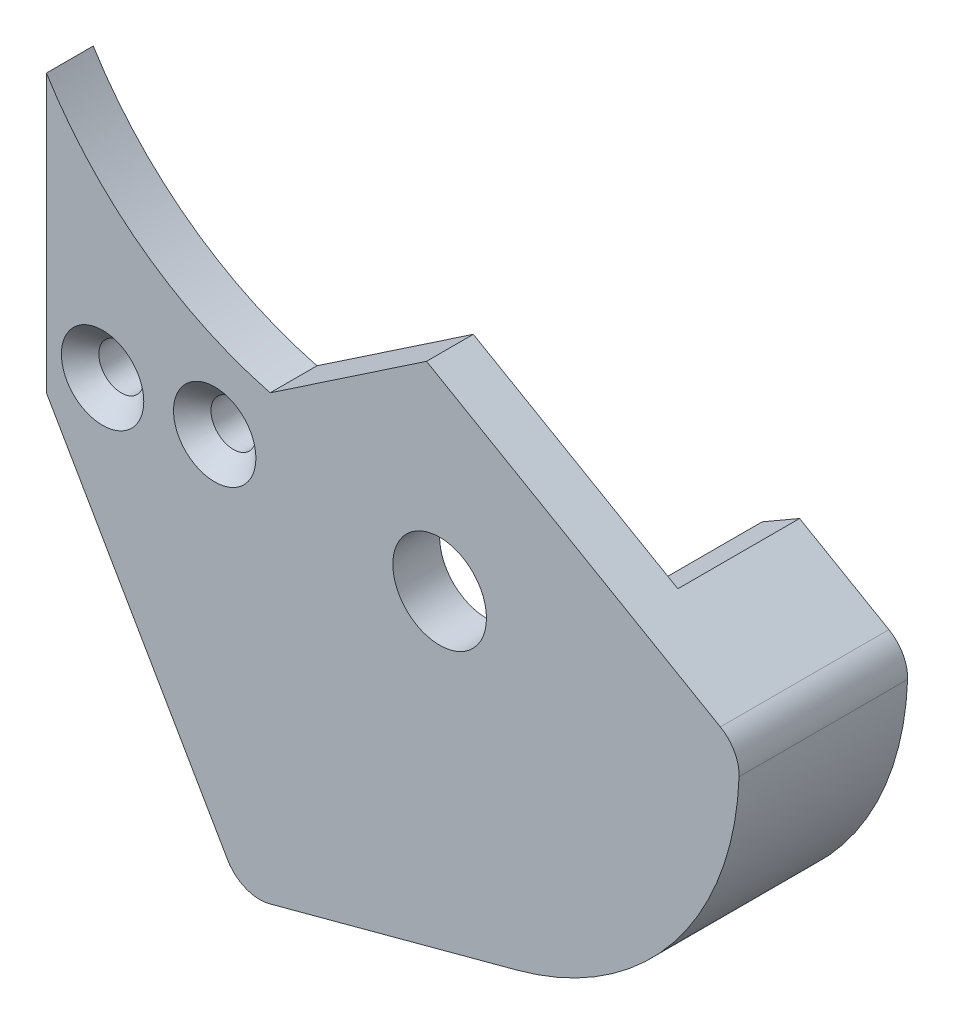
ISO-10303-21;
HEADER;
FILE_DESCRIPTION(('STEP AP214'),'2;1');
FILE_NAME('part.step','',(''),(''),'','','');
FILE_SCHEMA(('AUTOMOTIVE_DESIGN { 1 0 10303 214 1 1 1 1 }'));
ENDSEC;
DATA;
#1=APPLICATION_CONTEXT('core data for automotive mechanical design processes');
#2=APPLICATION_PROTOCOL_DEFINITION('international standard','automotive_design',2000,#1);
#3=PRODUCT_CONTEXT('',#1,'mechanical');
#4=PRODUCT('Part','Part','',(#3));
#5=PRODUCT_RELATED_PRODUCT_CATEGORY('part','',(#4));
#6=PRODUCT_DEFINITION_FORMATION('','',#4);
#7=PRODUCT_DEFINITION_CONTEXT('part definition',#1,'design');
#8=PRODUCT_DEFINITION('design','',#6,#7);
#9=PRODUCT_DEFINITION_SHAPE('','',#8);
#10=(LENGTH_UNIT() NAMED_UNIT(*) SI_UNIT(.MILLI.,.METRE.));
#11=(NAMED_UNIT(*) PLANE_ANGLE_UNIT() SI_UNIT($,.RADIAN.));
#12=(NAMED_UNIT(*) SI_UNIT($,.STERADIAN.) SOLID_ANGLE_UNIT());
#13=UNCERTAINTY_MEASURE_WITH_UNIT(LENGTH_MEASURE(1.E-05),#10,'distance_accuracy_value','');
#14=(GEOMETRIC_REPRESENTATION_CONTEXT(3) GLOBAL_UNCERTAINTY_ASSIGNED_CONTEXT((#13)) GLOBAL_UNIT_ASSIGNED_CONTEXT((#10,
#11,#12)) REPRESENTATION_CONTEXT('',''));
#15=CARTESIAN_POINT('',(0.,0.,0.));
#16=DIRECTION('',(0.,0.,1.));
#17=DIRECTION('',(1.,0.,0.));
#18=AXIS2_PLACEMENT_3D('',#15,#16,#17);
#19=CARTESIAN_POINT('',(29.3988570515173,26.4335149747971,0.));
#20=DIRECTION('',(0.,0.,-1.));
#21=DIRECTION('',(-1.,0.,0.));
#22=AXIS2_PLACEMENT_3D('',#19,#20,#21);
#23=PLANE('',#22);
#24=DIRECTION('',(-0.866025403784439,-0.5,0.));
#25=VECTOR('',#24,1.);
#26=CARTESIAN_POINT('',(25.9942197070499,33.3305198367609,0.));
#27=LINE('',#26,#25);
#28=CARTESIAN_POINT('',(25.5612070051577,33.0805198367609,0.));
#29=VERTEX_POINT('',#28);
#30=CARTESIAN_POINT('',(23.8291561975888,32.0805198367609,0.));
#31=VERTEX_POINT('',#30);
#32=EDGE_CURVE('E11',#29,#31,#27,.T.);
#33=ORIENTED_EDGE('',*,*,#32,.F.);
#34=DIRECTION('',(-0.5,0.866025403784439,0.));
#35=VECTOR('',#34,1.);
#36=CARTESIAN_POINT('',(19.7320508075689,43.1769145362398,0.));
#37=LINE('',#36,#35);
#38=CARTESIAN_POINT('',(28.6315300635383,27.7625643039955,0.));
#39=VERTEX_POINT('',#38);
#40=EDGE_CURVE('E258',#39,#29,#37,.T.);
#41=ORIENTED_EDGE('',*,*,#40,.F.);
#42=CARTESIAN_POINT('',(30.3635808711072,28.7625643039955,0.));
#43=DIRECTION('',(0.,0.,-1.));
#44=DIRECTION('',(-1.,0.,0.));
#45=AXIS2_PLACEMENT_3D('',#42,#43,#44);
#46=CIRCLE('',#45,2.);
#47=CARTESIAN_POINT('',(30.8812189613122,26.8307126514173,0.));
#48=VERTEX_POINT('',#47);
#49=EDGE_CURVE('E283',#48,#39,#46,.T.);
#50=ORIENTED_EDGE('',*,*,#49,.F.);
#51=DIRECTION('',(-0.965925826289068,-0.258819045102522,0.));
#52=VECTOR('',#51,1.);
#53=CARTESIAN_POINT('',(30.8812189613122,26.8307126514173,0.));
#54=LINE('',#53,#52);
#55=CARTESIAN_POINT('',(42.6234666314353,29.9770384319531,0.));
#56=VERTEX_POINT('',#55);
#57=EDGE_CURVE('E284',#56,#48,#54,.T.);
#58=ORIENTED_EDGE('',*,*,#57,.F.);
#59=CARTESIAN_POINT('',(39.,43.5,0.));
#60=DIRECTION('',(0.,0.,-1.));
#61=DIRECTION('',(1.,0.,0.));
#62=AXIS2_PLACEMENT_3D('',#59,#60,#61);
#63=CIRCLE('',#62,14.);
#64=CARTESIAN_POINT('',(52.8734632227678,41.6219642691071,0.));
#65=VERTEX_POINT('',#64);
#66=EDGE_CURVE('E341',#65,#56,#63,.T.);
#67=ORIENTED_EDGE('',*,*,#66,.F.);
#68=CARTESIAN_POINT('',(50.8915399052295,41.8902550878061,0.));
#69=DIRECTION('',(0.,0.,-1.));
#70=DIRECTION('',(-1.,0.,0.));
#71=AXIS2_PLACEMENT_3D('',#68,#69,#70);
#72=CIRCLE('',#71,2.);
#73=CARTESIAN_POINT('',(51.8915399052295,43.6223058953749,0.));
#74=VERTEX_POINT('',#73);
#75=EDGE_CURVE('E339',#74,#65,#72,.T.);
#76=ORIENTED_EDGE('',*,*,#75,.F.);
#77=DIRECTION('',(0.866025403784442,-0.499999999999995,0.));
#78=VECTOR('',#77,1.);
#79=CARTESIAN_POINT('',(47.2204784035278,46.3191445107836,0.));
#80=LINE('',#79,#78);
#81=CARTESIAN_POINT('',(47.2204784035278,46.3191445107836,0.));
#82=VERTEX_POINT('',#81);
#83=EDGE_CURVE('E337',#82,#74,#80,.T.);
#84=ORIENTED_EDGE('',*,*,#83,.F.);
#85=DIRECTION('',(-0.866025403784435,-0.500000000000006,0.));
#86=VECTOR('',#85,1.);
#87=CARTESIAN_POINT('',(47.2204784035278,46.3191445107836,0.));
#88=LINE('',#87,#86);
#89=CARTESIAN_POINT('',(49.2204784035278,47.4738450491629,0.));
#90=VERTEX_POINT('',#89);
#91=EDGE_CURVE('E335',#90,#82,#88,.T.);
#92=ORIENTED_EDGE('',*,*,#91,.F.);
#93=DIRECTION('',(-0.866025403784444,0.499999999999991,0.));
#94=VECTOR('',#93,1.);
#95=CARTESIAN_POINT('',(49.2204784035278,47.4738450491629,0.));
#96=LINE('',#95,#94);
#97=CARTESIAN_POINT('',(53.9906253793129,44.7197994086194,0.));
#98=VERTEX_POINT('',#97);
#99=EDGE_CURVE('E247',#98,#90,#96,.T.);
#100=ORIENTED_EDGE('',*,*,#99,.F.);
#101=CARTESIAN_POINT('',(52.9906253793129,42.9877486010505,0.));
#102=DIRECTION('',(0.,0.,1.));
#103=DIRECTION('',(-1.,0.,0.));
#104=AXIS2_PLACEMENT_3D('',#101,#102,#103);
#105=CIRCLE('',#104,2.);
#106=CARTESIAN_POINT('',(54.9892861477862,42.914569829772,0.));
#107=VERTEX_POINT('',#106);
#108=EDGE_CURVE('E332',#107,#98,#105,.T.);
#109=ORIENTED_EDGE('',*,*,#108,.F.);
#110=CARTESIAN_POINT('',(39.,43.5,0.));
#111=DIRECTION('',(0.,0.,1.));
#112=DIRECTION('',(1.,0.,0.));
#113=AXIS2_PLACEMENT_3D('',#110,#111,#112);
#114=CIRCLE('',#113,16.);
#115=CARTESIAN_POINT('',(43.1411047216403,28.0451867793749,0.));
#116=VERTEX_POINT('',#115);
#117=EDGE_CURVE('E327',#116,#107,#114,.T.);
#118=ORIENTED_EDGE('',*,*,#117,.F.);
#119=DIRECTION('',(0.965925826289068,0.258819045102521,0.));
#120=VECTOR('',#119,1.);
#121=CARTESIAN_POINT('',(29.9164951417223,24.501663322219,0.));
#122=LINE('',#121,#120);
#123=CARTESIAN_POINT('',(29.9164951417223,24.501663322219,0.));
#124=VERTEX_POINT('',#123);
#125=EDGE_CURVE('E325',#124,#116,#122,.T.);
#126=ORIENTED_EDGE('',*,*,#125,.F.);
#127=CARTESIAN_POINT('',(29.3988570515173,26.4335149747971,0.));
#128=DIRECTION('',(0.,0.,1.));
#129=DIRECTION('',(-1.,0.,0.));
#130=AXIS2_PLACEMENT_3D('',#127,#128,#129);
#131=CIRCLE('',#130,2.);
#132=CARTESIAN_POINT('',(27.6668062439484,25.4335149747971,0.));
#133=VERTEX_POINT('',#132);
#134=EDGE_CURVE('E318',#133,#124,#131,.T.);
#135=ORIENTED_EDGE('',*,*,#134,.F.);
#136=DIRECTION('',(0.5,-0.866025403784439,0.));
#137=VECTOR('',#136,1.);
#138=CARTESIAN_POINT('',(18.,42.1769145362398,0.));
#139=LINE('',#138,#137);
#140=EDGE_CURVE('E202',#31,#133,#139,.T.);
#141=ORIENTED_EDGE('',*,*,#140,.F.);
#142=EDGE_LOOP('',(#33,#41,#50,#58,#67,#76,#84,#92,#100,#109,#118,#126,#135,#141));
#143=FACE_BOUND('',#142,.T.);
#144=ADVANCED_FACE('F33',(#143),#23,.T.);
#145=CARTESIAN_POINT('',(18.,42.1769145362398,6.5));
#146=DIRECTION('',(0.866025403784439,0.5,0.));
#147=DIRECTION('',(-0.5,0.866025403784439,0.));
#148=AXIS2_PLACEMENT_3D('',#145,#146,#147);
#149=PLANE('',#148);
#150=CARTESIAN_POINT('',(18.,42.1769145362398,0.));
#151=VERTEX_POINT('',#150);
#152=CARTESIAN_POINT('',(22.1708438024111,34.95280116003,0.));
#153=VERTEX_POINT('',#152);
#154=EDGE_CURVE('E205',#151,#153,#139,.T.);
#155=ORIENTED_EDGE('',*,*,#154,.T.);
#156=CARTESIAN_POINT('',(23.,33.5166604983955,2.5));
#157=DIRECTION('',(-0.866025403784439,-0.5,0.));
#158=DIRECTION('',(0.5,-0.866025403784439,0.));
#159=AXIS2_PLACEMENT_3D('',#156,#157,#158);
#160=CIRCLE('',#159,3.);
#161=EDGE_CURVE('E56',#31,#153,#160,.T.);
#162=ORIENTED_EDGE('',*,*,#161,.F.);
#163=ORIENTED_EDGE('',*,*,#140,.T.);
#164=DIRECTION('',(0.,0.,-1.));
#165=VECTOR('',#164,1.);
#166=CARTESIAN_POINT('',(27.6668062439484,25.4335149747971,6.5));
#167=LINE('',#166,#165);
#168=CARTESIAN_POINT('',(27.6668062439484,25.4335149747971,9.));
#169=VERTEX_POINT('',#168);
#170=EDGE_CURVE('E197',#169,#133,#167,.T.);
#171=ORIENTED_EDGE('',*,*,#170,.F.);
#172=DIRECTION('',(0.5,-0.866025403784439,0.));
#173=VECTOR('',#172,1.);
#174=CARTESIAN_POINT('',(18.,42.1769145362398,9.));
#175=LINE('',#174,#173);
#176=CARTESIAN_POINT('',(18.,42.1769145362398,9.));
#177=VERTEX_POINT('',#176);
#178=EDGE_CURVE('E200',#177,#169,#175,.T.);
#179=ORIENTED_EDGE('',*,*,#178,.F.);
#180=DIRECTION('',(0.,0.,-1.));
#181=VECTOR('',#180,1.);
#182=CARTESIAN_POINT('',(18.,42.1769145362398,9.));
#183=LINE('',#182,#181);
#184=CARTESIAN_POINT('',(18.,42.1769145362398,6.5));
#185=VERTEX_POINT('',#184);
#186=EDGE_CURVE('E173',#177,#185,#183,.T.);
#187=ORIENTED_EDGE('',*,*,#186,.T.);
#188=DIRECTION('',(0.,0.,-1.));
#189=VECTOR('',#188,1.);
#190=CARTESIAN_POINT('',(18.,42.1769145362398,6.5));
#191=LINE('',#190,#189);
#192=EDGE_CURVE('E192',#185,#151,#191,.T.);
#193=ORIENTED_EDGE('',*,*,#192,.T.);
#194=EDGE_LOOP('',(#155,#162,#163,#171,#179,#187,#193));
#195=FACE_BOUND('',#194,.T.);
#196=ADVANCED_FACE('F35',(#195),#149,.F.);
#197=CARTESIAN_POINT('',(29.3988570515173,26.4335149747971,6.5));
#198=DIRECTION('',(0.,0.,-1.));
#199=DIRECTION('',(-1.,0.,0.));
#200=AXIS2_PLACEMENT_3D('',#197,#198,#199);
#201=CYLINDRICAL_SURFACE('',#200,2.);
#202=ORIENTED_EDGE('',*,*,#134,.T.);
#203=DIRECTION('',(0.,0.,-1.));
#204=VECTOR('',#203,1.);
#205=CARTESIAN_POINT('',(29.9164951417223,24.501663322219,6.5));
#206=LINE('',#205,#204);
#207=CARTESIAN_POINT('',(29.9164951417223,24.501663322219,9.));
#208=VERTEX_POINT('',#207);
#209=EDGE_CURVE('E310',#208,#124,#206,.T.);
#210=ORIENTED_EDGE('',*,*,#209,.F.);
#211=CARTESIAN_POINT('',(29.3988570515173,26.4335149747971,9.));
#212=DIRECTION('',(0.,0.,1.));
#213=DIRECTION('',(-1.,0.,0.));
#214=AXIS2_PLACEMENT_3D('',#211,#212,#213);
#215=CIRCLE('',#214,2.);
#216=EDGE_CURVE('E320',#169,#208,#215,.T.);
#217=ORIENTED_EDGE('',*,*,#216,.F.);
#218=ORIENTED_EDGE('',*,*,#170,.T.);
#219=EDGE_LOOP('',(#202,#210,#217,#218));
#220=FACE_BOUND('',#219,.T.);
#221=ADVANCED_FACE('F317',(#220),#201,.T.);
#222=CARTESIAN_POINT('',(29.9164951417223,24.501663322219,6.5));
#223=DIRECTION('',(-0.258819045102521,0.965925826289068,0.));
#224=DIRECTION('',(-0.965925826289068,-0.258819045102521,0.));
#225=AXIS2_PLACEMENT_3D('',#222,#223,#224);
#226=PLANE('',#225);
#227=ORIENTED_EDGE('',*,*,#125,.T.);
#228=DIRECTION('',(0.,0.,-1.));
#229=VECTOR('',#228,1.);
#230=CARTESIAN_POINT('',(43.1411047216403,28.0451867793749,6.5));
#231=LINE('',#230,#229);
#232=CARTESIAN_POINT('',(43.1411047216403,28.0451867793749,9.));
#233=VERTEX_POINT('',#232);
#234=EDGE_CURVE('E307',#233,#116,#231,.T.);
#235=ORIENTED_EDGE('',*,*,#234,.F.);
#236=DIRECTION('',(0.965925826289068,0.258819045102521,0.));
#237=VECTOR('',#236,1.);
#238=CARTESIAN_POINT('',(29.9164951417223,24.501663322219,9.));
#239=LINE('',#238,#237);
#240=EDGE_CURVE('E364',#208,#233,#239,.T.);
#241=ORIENTED_EDGE('',*,*,#240,.F.);
#242=ORIENTED_EDGE('',*,*,#209,.T.);
#243=EDGE_LOOP('',(#227,#235,#241,#242));
#244=FACE_BOUND('',#243,.T.);
#245=ADVANCED_FACE('F487',(#244),#226,.F.);
#246=CARTESIAN_POINT('',(39.,43.5,6.5));
#247=DIRECTION('',(0.,0.,-1.));
#248=DIRECTION('',(-1.,0.,0.));
#249=AXIS2_PLACEMENT_3D('',#246,#247,#248);
#250=CYLINDRICAL_SURFACE('',#249,16.);
#251=ORIENTED_EDGE('',*,*,#117,.T.);
#252=DIRECTION('',(0.,0.,-1.));
#253=VECTOR('',#252,1.);
#254=CARTESIAN_POINT('',(54.9892861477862,42.914569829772,6.5));
#255=LINE('',#254,#253);
#256=CARTESIAN_POINT('',(54.9892861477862,42.914569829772,9.));
#257=VERTEX_POINT('',#256);
#258=EDGE_CURVE('E304',#257,#107,#255,.T.);
#259=ORIENTED_EDGE('',*,*,#258,.F.);
#260=CARTESIAN_POINT('',(39.,43.5,9.));
#261=DIRECTION('',(0.,0.,1.));
#262=DIRECTION('',(1.,0.,0.));
#263=AXIS2_PLACEMENT_3D('',#260,#261,#262);
#264=CIRCLE('',#263,16.);
#265=EDGE_CURVE('E367',#233,#257,#264,.T.);
#266=ORIENTED_EDGE('',*,*,#265,.F.);
#267=ORIENTED_EDGE('',*,*,#234,.T.);
#268=EDGE_LOOP('',(#251,#259,#266,#267));
#269=FACE_BOUND('',#268,.T.);
#270=ADVANCED_FACE('F477',(#269),#250,.T.);
#271=CARTESIAN_POINT('',(52.9906253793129,42.9877486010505,6.5));
#272=DIRECTION('',(0.,0.,-1.));
#273=DIRECTION('',(-1.,0.,0.));
#274=AXIS2_PLACEMENT_3D('',#271,#272,#273);
#275=CYLINDRICAL_SURFACE('',#274,2.);
#276=ORIENTED_EDGE('',*,*,#108,.T.);
#277=DIRECTION('',(0.,0.,-1.));
#278=VECTOR('',#277,1.);
#279=CARTESIAN_POINT('',(53.9906253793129,44.7197994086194,6.5));
#280=LINE('',#279,#278);
#281=CARTESIAN_POINT('',(53.9906253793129,44.7197994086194,9.));
#282=VERTEX_POINT('',#281);
#283=EDGE_CURVE('E250',#282,#98,#280,.T.);
#284=ORIENTED_EDGE('',*,*,#283,.F.);
#285=CARTESIAN_POINT('',(52.9906253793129,42.9877486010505,9.));
#286=DIRECTION('',(0.,0.,1.));
#287=DIRECTION('',(-1.,0.,0.));
#288=AXIS2_PLACEMENT_3D('',#285,#286,#287);
#289=CIRCLE('',#288,2.);
#290=EDGE_CURVE('E370',#257,#282,#289,.T.);
#291=ORIENTED_EDGE('',*,*,#290,.F.);
#292=ORIENTED_EDGE('',*,*,#258,.T.);
#293=EDGE_LOOP('',(#276,#284,#291,#292));
#294=FACE_BOUND('',#293,.T.);
#295=ADVANCED_FACE('F380',(#294),#275,.T.);
#296=CARTESIAN_POINT('',(49.2204784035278,47.4738450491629,6.5));
#297=DIRECTION('',(-0.499999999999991,-0.866025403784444,0.));
#298=DIRECTION('',(0.866025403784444,-0.499999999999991,0.));
#299=AXIS2_PLACEMENT_3D('',#296,#297,#298);
#300=PLANE('',#299);
#301=ORIENTED_EDGE('',*,*,#99,.T.);
#302=DIRECTION('',(0.,0.,-1.));
#303=VECTOR('',#302,1.);
#304=CARTESIAN_POINT('',(49.2204784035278,47.4738450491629,6.5));
#305=LINE('',#304,#303);
#306=CARTESIAN_POINT('',(49.2204784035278,47.4738450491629,6.5));
#307=VERTEX_POINT('',#306);
#308=EDGE_CURVE('E244',#307,#90,#305,.T.);
#309=ORIENTED_EDGE('',*,*,#308,.F.);
#310=DIRECTION('',(-0.866025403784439,0.5,0.));
#311=VECTOR('',#310,1.);
#312=CARTESIAN_POINT('',(38.2975696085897,53.7801893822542,6.5));
#313=LINE('',#312,#311);
#314=CARTESIAN_POINT('',(38.2975696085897,53.7801893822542,6.5));
#315=VERTEX_POINT('',#314);
#316=EDGE_CURVE('E178',#307,#315,#313,.T.);
#317=ORIENTED_EDGE('',*,*,#316,.T.);
#318=DIRECTION('',(0.,0.,-1.));
#319=VECTOR('',#318,1.);
#320=CARTESIAN_POINT('',(38.2975696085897,53.7801893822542,9.));
#321=LINE('',#320,#319);
#322=CARTESIAN_POINT('',(38.2975696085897,53.7801893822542,9.));
#323=VERTEX_POINT('',#322);
#324=EDGE_CURVE('E203',#323,#315,#321,.T.);
#325=ORIENTED_EDGE('',*,*,#324,.F.);
#326=DIRECTION('',(-0.866025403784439,0.5,0.));
#327=VECTOR('',#326,1.);
#328=CARTESIAN_POINT('',(38.2975696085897,53.7801893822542,9.));
#329=LINE('',#328,#327);
#330=EDGE_CURVE('E242',#282,#323,#329,.T.);
#331=ORIENTED_EDGE('',*,*,#330,.F.);
#332=ORIENTED_EDGE('',*,*,#283,.T.);
#333=EDGE_LOOP('',(#301,#309,#317,#325,#331,#332));
#334=FACE_BOUND('',#333,.T.);
#335=ADVANCED_FACE('F240',(#334),#300,.F.);
#336=CARTESIAN_POINT('',(47.2204784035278,46.3191445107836,6.5));
#337=DIRECTION('',(0.500000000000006,-0.866025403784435,0.));
#338=DIRECTION('',(0.866025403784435,0.500000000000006,0.));
#339=AXIS2_PLACEMENT_3D('',#336,#337,#338);
#340=PLANE('',#339);
#341=ORIENTED_EDGE('',*,*,#91,.T.);
#342=DIRECTION('',(0.,0.,-1.));
#343=VECTOR('',#342,1.);
#344=CARTESIAN_POINT('',(47.2204784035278,46.3191445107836,6.5));
#345=LINE('',#344,#343);
#346=CARTESIAN_POINT('',(47.2204784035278,46.3191445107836,6.5));
#347=VERTEX_POINT('',#346);
#348=EDGE_CURVE('E251',#347,#82,#345,.T.);
#349=ORIENTED_EDGE('',*,*,#348,.F.);
#350=DIRECTION('',(-0.866025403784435,-0.500000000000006,0.));
#351=VECTOR('',#350,1.);
#352=CARTESIAN_POINT('',(47.2204784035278,46.3191445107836,6.5));
#353=LINE('',#352,#351);
#354=EDGE_CURVE('E253',#307,#347,#353,.T.);
#355=ORIENTED_EDGE('',*,*,#354,.F.);
#356=ORIENTED_EDGE('',*,*,#308,.T.);
#357=EDGE_LOOP('',(#341,#349,#355,#356));
#358=FACE_BOUND('',#357,.T.);
#359=ADVANCED_FACE('F254',(#358),#340,.F.);
#360=CARTESIAN_POINT('',(47.2204784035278,46.3191445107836,6.5));
#361=DIRECTION('',(0.499999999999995,0.866025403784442,0.));
#362=DIRECTION('',(-0.866025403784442,0.499999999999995,0.));
#363=AXIS2_PLACEMENT_3D('',#360,#361,#362);
#364=PLANE('',#363);
#365=ORIENTED_EDGE('',*,*,#83,.T.);
#366=DIRECTION('',(0.,0.,-1.));
#367=VECTOR('',#366,1.);
#368=CARTESIAN_POINT('',(51.8915399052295,43.6223058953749,6.5));
#369=LINE('',#368,#367);
#370=CARTESIAN_POINT('',(51.8915399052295,43.6223058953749,6.5));
#371=VERTEX_POINT('',#370);
#372=EDGE_CURVE('E299',#371,#74,#369,.T.);
#373=ORIENTED_EDGE('',*,*,#372,.F.);
#374=DIRECTION('',(0.866025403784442,-0.499999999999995,0.));
#375=VECTOR('',#374,1.);
#376=CARTESIAN_POINT('',(47.2204784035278,46.3191445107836,6.5));
#377=LINE('',#376,#375);
#378=EDGE_CURVE('E215',#347,#371,#377,.T.);
#379=ORIENTED_EDGE('',*,*,#378,.F.);
#380=ORIENTED_EDGE('',*,*,#348,.T.);
#381=EDGE_LOOP('',(#365,#373,#379,#380));
#382=FACE_BOUND('',#381,.T.);
#383=ADVANCED_FACE('F385',(#382),#364,.F.);
#384=CARTESIAN_POINT('',(50.8915399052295,41.8902550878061,6.5));
#385=DIRECTION('',(0.,0.,-1.));
#386=DIRECTION('',(-1.,0.,0.));
#387=AXIS2_PLACEMENT_3D('',#384,#385,#386);
#388=CYLINDRICAL_SURFACE('',#387,2.);
#389=ORIENTED_EDGE('',*,*,#75,.T.);
#390=DIRECTION('',(0.,0.,-1.));
#391=VECTOR('',#390,1.);
#392=CARTESIAN_POINT('',(52.8734632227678,41.6219642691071,6.5));
#393=LINE('',#392,#391);
#394=CARTESIAN_POINT('',(52.8734632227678,41.6219642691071,6.5));
#395=VERTEX_POINT('',#394);
#396=EDGE_CURVE('E296',#395,#65,#393,.T.);
#397=ORIENTED_EDGE('',*,*,#396,.F.);
#398=CARTESIAN_POINT('',(50.8915399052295,41.8902550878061,6.5));
#399=DIRECTION('',(0.,0.,-1.));
#400=DIRECTION('',(-1.,0.,0.));
#401=AXIS2_PLACEMENT_3D('',#398,#399,#400);
#402=CIRCLE('',#401,2.);
#403=EDGE_CURVE('E260',#371,#395,#402,.T.);
#404=ORIENTED_EDGE('',*,*,#403,.F.);
#405=ORIENTED_EDGE('',*,*,#372,.T.);
#406=EDGE_LOOP('',(#389,#397,#404,#405));
#407=FACE_BOUND('',#406,.T.);
#408=ADVANCED_FACE('F396',(#407),#388,.F.);
#409=CARTESIAN_POINT('',(39.,43.5,6.5));
#410=DIRECTION('',(0.,0.,-1.));
#411=DIRECTION('',(-1.,0.,0.));
#412=AXIS2_PLACEMENT_3D('',#409,#410,#411);
#413=CYLINDRICAL_SURFACE('',#412,14.);
#414=ORIENTED_EDGE('',*,*,#66,.T.);
#415=DIRECTION('',(0.,0.,-1.));
#416=VECTOR('',#415,1.);
#417=CARTESIAN_POINT('',(42.6234666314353,29.9770384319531,6.5));
#418=LINE('',#417,#416);
#419=CARTESIAN_POINT('',(42.6234666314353,29.9770384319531,6.5));
#420=VERTEX_POINT('',#419);
#421=EDGE_CURVE('E293',#420,#56,#418,.T.);
#422=ORIENTED_EDGE('',*,*,#421,.F.);
#423=CARTESIAN_POINT('',(39.,43.5,6.5));
#424=DIRECTION('',(0.,0.,-1.));
#425=DIRECTION('',(1.,0.,0.));
#426=AXIS2_PLACEMENT_3D('',#423,#424,#425);
#427=CIRCLE('',#426,14.);
#428=EDGE_CURVE('E390',#395,#420,#427,.T.);
#429=ORIENTED_EDGE('',*,*,#428,.F.);
#430=ORIENTED_EDGE('',*,*,#396,.T.);
#431=EDGE_LOOP('',(#414,#422,#429,#430));
#432=FACE_BOUND('',#431,.T.);
#433=ADVANCED_FACE('F398',(#432),#413,.F.);
#434=CARTESIAN_POINT('',(30.8812189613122,26.8307126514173,6.5));
#435=DIRECTION('',(0.258819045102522,-0.965925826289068,0.));
#436=DIRECTION('',(0.965925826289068,0.258819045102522,0.));
#437=AXIS2_PLACEMENT_3D('',#434,#435,#436);
#438=PLANE('',#437);
#439=ORIENTED_EDGE('',*,*,#57,.T.);
#440=DIRECTION('',(0.,0.,-1.));
#441=VECTOR('',#440,1.);
#442=CARTESIAN_POINT('',(30.8812189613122,26.8307126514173,6.5));
#443=LINE('',#442,#441);
#444=CARTESIAN_POINT('',(30.8812189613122,26.8307126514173,6.5));
#445=VERTEX_POINT('',#444);
#446=EDGE_CURVE('E290',#445,#48,#443,.T.);
#447=ORIENTED_EDGE('',*,*,#446,.F.);
#448=DIRECTION('',(-0.965925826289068,-0.258819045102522,0.));
#449=VECTOR('',#448,1.);
#450=CARTESIAN_POINT('',(30.8812189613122,26.8307126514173,6.5));
#451=LINE('',#450,#449);
#452=EDGE_CURVE('E392',#420,#445,#451,.T.);
#453=ORIENTED_EDGE('',*,*,#452,.F.);
#454=ORIENTED_EDGE('',*,*,#421,.T.);
#455=EDGE_LOOP('',(#439,#447,#453,#454));
#456=FACE_BOUND('',#455,.T.);
#457=ADVANCED_FACE('F344',(#456),#438,.F.);
#458=CARTESIAN_POINT('',(30.3635808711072,28.7625643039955,6.5));
#459=DIRECTION('',(0.,0.,-1.));
#460=DIRECTION('',(-1.,0.,0.));
#461=AXIS2_PLACEMENT_3D('',#458,#459,#460);
#462=CYLINDRICAL_SURFACE('',#461,2.);
#463=ORIENTED_EDGE('',*,*,#49,.T.);
#464=DIRECTION('',(0.,0.,-1.));
#465=VECTOR('',#464,1.);
#466=CARTESIAN_POINT('',(28.6315300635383,27.7625643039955,6.5));
#467=LINE('',#466,#465);
#468=CARTESIAN_POINT('',(28.6315300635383,27.7625643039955,6.5));
#469=VERTEX_POINT('',#468);
#470=EDGE_CURVE('E288',#469,#39,#467,.T.);
#471=ORIENTED_EDGE('',*,*,#470,.F.);
#472=CARTESIAN_POINT('',(30.3635808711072,28.7625643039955,6.5));
#473=DIRECTION('',(0.,0.,-1.));
#474=DIRECTION('',(-1.,0.,0.));
#475=AXIS2_PLACEMENT_3D('',#472,#473,#474);
#476=CIRCLE('',#475,2.);
#477=EDGE_CURVE('E351',#445,#469,#476,.T.);
#478=ORIENTED_EDGE('',*,*,#477,.F.);
#479=ORIENTED_EDGE('',*,*,#446,.T.);
#480=EDGE_LOOP('',(#463,#471,#478,#479));
#481=FACE_BOUND('',#480,.T.);
#482=ADVANCED_FACE('F350',(#481),#462,.F.);
#483=CARTESIAN_POINT('',(19.7320508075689,43.1769145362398,6.5));
#484=DIRECTION('',(-0.866025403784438,-0.5,0.));
#485=DIRECTION('',(0.5,-0.866025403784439,0.));
#486=AXIS2_PLACEMENT_3D('',#483,#484,#485);
#487=PLANE('',#486);
#488=CARTESIAN_POINT('',(23.90289460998,35.95280116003,0.));
#489=VERTEX_POINT('',#488);
#490=CARTESIAN_POINT('',(20.2283441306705,42.3173092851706,0.));
#491=VERTEX_POINT('',#490);
#492=EDGE_CURVE('E262',#489,#491,#37,.T.);
#493=ORIENTED_EDGE('',*,*,#492,.T.);
#494=DIRECTION('',(0.,0.,1.));
#495=VECTOR('',#494,1.);
#496=CARTESIAN_POINT('',(20.2283441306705,42.3173092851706,6.5));
#497=LINE('',#496,#495);
#498=CARTESIAN_POINT('',(20.2283441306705,42.3173092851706,6.5));
#499=VERTEX_POINT('',#498);
#500=EDGE_CURVE('E49',#491,#499,#497,.T.);
#501=ORIENTED_EDGE('',*,*,#500,.T.);
#502=DIRECTION('',(-0.5,0.866025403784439,0.));
#503=VECTOR('',#502,1.);
#504=CARTESIAN_POINT('',(19.7320508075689,43.1769145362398,6.5));
#505=LINE('',#504,#503);
#506=EDGE_CURVE('E188',#469,#499,#505,.T.);
#507=ORIENTED_EDGE('',*,*,#506,.F.);
#508=ORIENTED_EDGE('',*,*,#470,.T.);
#509=ORIENTED_EDGE('',*,*,#40,.T.);
#510=CARTESIAN_POINT('',(24.7320508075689,34.5166604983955,2.5));
#511=DIRECTION('',(-0.866025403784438,-0.5,0.));
#512=DIRECTION('',(0.5,-0.866025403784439,0.));
#513=AXIS2_PLACEMENT_3D('',#510,#511,#512);
#514=CIRCLE('',#513,3.);
#515=EDGE_CURVE('E271',#29,#489,#514,.T.);
#516=ORIENTED_EDGE('',*,*,#515,.T.);
#517=EDGE_LOOP('',(#493,#501,#507,#508,#509,#516));
#518=FACE_BOUND('',#517,.T.);
#519=ADVANCED_FACE('F277',(#518),#487,.F.);
#520=DIRECTION('',(-0.998021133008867,-0.0628793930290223,0.));
#521=VECTOR('',#520,1.);
#522=CARTESIAN_POINT('',(18.,42.1769145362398,0.));
#523=LINE('',#522,#521);
#524=EDGE_CURVE('E189',#491,#151,#523,.T.);
#525=ORIENTED_EDGE('',*,*,#524,.F.);
#526=ORIENTED_EDGE('',*,*,#492,.F.);
#527=DIRECTION('',(-0.866025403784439,-0.5,0.));
#528=VECTOR('',#527,1.);
#529=CARTESIAN_POINT('',(24.3359073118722,36.20280116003,0.));
#530=LINE('',#529,#528);
#531=EDGE_CURVE('E42',#153,#489,#530,.F.);
#532=ORIENTED_EDGE('',*,*,#531,.F.);
#533=ORIENTED_EDGE('',*,*,#154,.F.);
#534=EDGE_LOOP('',(#525,#526,#532,#533));
#535=FACE_BOUND('',#534,.T.);
#536=ADVANCED_FACE('F282',(#535),#23,.T.);
#537=CARTESIAN_POINT('',(35.,67.5,6.5));
#538=DIRECTION('',(0.,0.,1.));
#539=DIRECTION('',(1.,0.,0.));
#540=AXIS2_PLACEMENT_3D('',#537,#538,#539);
#541=PLANE('',#540);
#542=CARTESIAN_POINT('',(26.9881267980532,44.7471686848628,6.5));
#543=DIRECTION('',(0.,0.,1.));
#544=DIRECTION('',(1.,0.,0.));
#545=AXIS2_PLACEMENT_3D('',#542,#543,#544);
#546=CIRCLE('',#545,1.2);
#547=CARTESIAN_POINT('',(28.1881267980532,44.7471686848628,6.5));
#548=VERTEX_POINT('',#547);
#549=EDGE_CURVE('E643',#548,#548,#546,.T.);
#550=ORIENTED_EDGE('',*,*,#549,.T.);
#551=EDGE_LOOP('',(#550));
#552=FACE_BOUND('',#551,.T.);
#553=CARTESIAN_POINT('',(21.,44.3698923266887,6.5));
#554=DIRECTION('',(0.,0.,1.));
#555=DIRECTION('',(1.,0.,0.));
#556=AXIS2_PLACEMENT_3D('',#553,#554,#555);
#557=CIRCLE('',#556,1.2);
#558=CARTESIAN_POINT('',(22.2,44.3698923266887,6.5));
#559=VERTEX_POINT('',#558);
#560=EDGE_CURVE('E37',#559,#559,#557,.T.);
#561=ORIENTED_EDGE('',*,*,#560,.T.);
#562=EDGE_LOOP('',(#561));
#563=FACE_BOUND('',#562,.T.);
#564=DIRECTION('',(-0.998021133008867,-0.0628793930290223,0.));
#565=VECTOR('',#564,1.);
#566=CARTESIAN_POINT('',(18.,42.1769145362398,6.5));
#567=LINE('',#566,#565);
#568=EDGE_CURVE('E182',#499,#185,#567,.T.);
#569=ORIENTED_EDGE('',*,*,#568,.T.);
#570=DIRECTION('',(0.,-1.,0.));
#571=VECTOR('',#570,1.);
#572=CARTESIAN_POINT('',(18.,42.1769145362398,6.5));
#573=LINE('',#572,#571);
#574=CARTESIAN_POINT('',(18.,56.9643462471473,6.5));
#575=VERTEX_POINT('',#574);
#576=EDGE_CURVE('E168',#575,#185,#573,.T.);
#577=ORIENTED_EDGE('',*,*,#576,.F.);
#578=CARTESIAN_POINT('',(35.,67.5,6.5));
#579=DIRECTION('',(0.,0.,-1.));
#580=DIRECTION('',(1.,0.,0.));
#581=AXIS2_PLACEMENT_3D('',#578,#579,#580);
#582=CIRCLE('',#581,20.);
#583=CARTESIAN_POINT('',(29.948140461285,48.1485474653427,6.5));
#584=VERTEX_POINT('',#583);
#585=EDGE_CURVE('E221',#584,#575,#582,.T.);
#586=ORIENTED_EDGE('',*,*,#585,.F.);
#587=DIRECTION('',(-0.829043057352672,-0.559184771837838,0.));
#588=VECTOR('',#587,1.);
#589=CARTESIAN_POINT('',(38.2975696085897,53.7801893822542,6.5));
#590=LINE('',#589,#588);
#591=EDGE_CURVE('E214',#315,#584,#590,.T.);
#592=ORIENTED_EDGE('',*,*,#591,.F.);
#593=ORIENTED_EDGE('',*,*,#316,.F.);
#594=ORIENTED_EDGE('',*,*,#354,.T.);
#595=ORIENTED_EDGE('',*,*,#378,.T.);
#596=ORIENTED_EDGE('',*,*,#403,.T.);
#597=ORIENTED_EDGE('',*,*,#428,.T.);
#598=ORIENTED_EDGE('',*,*,#452,.T.);
#599=ORIENTED_EDGE('',*,*,#477,.T.);
#600=ORIENTED_EDGE('',*,*,#506,.T.);
#601=EDGE_LOOP('',(#569,#577,#586,#592,#593,#594,#595,#596,#597,#598,#599,#600));
#602=FACE_BOUND('',#601,.T.);
#603=CARTESIAN_POINT('',(39.,43.5,6.5));
#604=DIRECTION('',(0.,0.,1.));
#605=DIRECTION('',(1.,0.,0.));
#606=AXIS2_PLACEMENT_3D('',#603,#604,#605);
#607=CIRCLE('',#606,2.5);
#608=CARTESIAN_POINT('',(41.5,43.5,6.5));
#609=VERTEX_POINT('',#608);
#610=EDGE_CURVE('E280',#609,#609,#607,.T.);
#611=ORIENTED_EDGE('',*,*,#610,.T.);
#612=EDGE_LOOP('',(#611));
#613=FACE_BOUND('',#612,.T.);
#614=ADVANCED_FACE('F184',(#552,#563,#602,#613),#541,.F.);
#615=CARTESIAN_POINT('',(35.,67.5,9.));
#616=DIRECTION('',(0.,0.,1.));
#617=DIRECTION('',(1.,0.,0.));
#618=AXIS2_PLACEMENT_3D('',#615,#616,#617);
#619=PLANE('',#618);
#620=CARTESIAN_POINT('',(26.9881267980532,44.7471686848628,9.));
#621=DIRECTION('',(0.,0.,1.));
#622=DIRECTION('',(1.,0.,0.));
#623=AXIS2_PLACEMENT_3D('',#620,#621,#622);
#624=CIRCLE('',#623,2.2);
#625=CARTESIAN_POINT('',(29.1881267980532,44.7471686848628,9.));
#626=VERTEX_POINT('',#625);
#627=EDGE_CURVE('E642',#626,#626,#624,.T.);
#628=ORIENTED_EDGE('',*,*,#627,.F.);
#629=EDGE_LOOP('',(#628));
#630=FACE_BOUND('',#629,.T.);
#631=CARTESIAN_POINT('',(21.,44.3698923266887,9.));
#632=DIRECTION('',(0.,0.,1.));
#633=DIRECTION('',(1.,0.,0.));
#634=AXIS2_PLACEMENT_3D('',#631,#632,#633);
#635=CIRCLE('',#634,2.2);
#636=CARTESIAN_POINT('',(23.2,44.3698923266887,9.));
#637=VERTEX_POINT('',#636);
#638=EDGE_CURVE('E649',#637,#637,#635,.T.);
#639=ORIENTED_EDGE('',*,*,#638,.F.);
#640=EDGE_LOOP('',(#639));
#641=FACE_BOUND('',#640,.T.);
#642=DIRECTION('',(0.,-1.,0.));
#643=VECTOR('',#642,1.);
#644=CARTESIAN_POINT('',(18.,42.1769145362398,9.));
#645=LINE('',#644,#643);
#646=CARTESIAN_POINT('',(18.,56.9643462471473,9.));
#647=VERTEX_POINT('',#646);
#648=EDGE_CURVE('E223',#647,#177,#645,.T.);
#649=ORIENTED_EDGE('',*,*,#648,.T.);
#650=ORIENTED_EDGE('',*,*,#178,.T.);
#651=ORIENTED_EDGE('',*,*,#216,.T.);
#652=ORIENTED_EDGE('',*,*,#240,.T.);
#653=ORIENTED_EDGE('',*,*,#265,.T.);
#654=ORIENTED_EDGE('',*,*,#290,.T.);
#655=ORIENTED_EDGE('',*,*,#330,.T.);
#656=DIRECTION('',(-0.829043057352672,-0.559184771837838,0.));
#657=VECTOR('',#656,1.);
#658=CARTESIAN_POINT('',(38.2975696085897,53.7801893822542,9.));
#659=LINE('',#658,#657);
#660=CARTESIAN_POINT('',(29.948140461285,48.1485474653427,9.));
#661=VERTEX_POINT('',#660);
#662=EDGE_CURVE('E237',#323,#661,#659,.T.);
#663=ORIENTED_EDGE('',*,*,#662,.T.);
#664=CARTESIAN_POINT('',(35.,67.5,9.));
#665=DIRECTION('',(0.,0.,-1.));
#666=DIRECTION('',(1.,0.,0.));
#667=AXIS2_PLACEMENT_3D('',#664,#665,#666);
#668=CIRCLE('',#667,20.);
#669=EDGE_CURVE('E224',#661,#647,#668,.T.);
#670=ORIENTED_EDGE('',*,*,#669,.T.);
#671=EDGE_LOOP('',(#649,#650,#651,#652,#653,#654,#655,#663,#670));
#672=FACE_BOUND('',#671,.T.);
#673=CARTESIAN_POINT('',(39.,43.5,9.));
#674=DIRECTION('',(0.,0.,1.));
#675=DIRECTION('',(1.,0.,0.));
#676=AXIS2_PLACEMENT_3D('',#673,#674,#675);
#677=CIRCLE('',#676,2.5);
#678=CARTESIAN_POINT('',(41.5,43.5,9.));
#679=VERTEX_POINT('',#678);
#680=EDGE_CURVE('E179',#679,#679,#677,.T.);
#681=ORIENTED_EDGE('',*,*,#680,.F.);
#682=EDGE_LOOP('',(#681));
#683=FACE_BOUND('',#682,.T.);
#684=ADVANCED_FACE('F375',(#630,#641,#672,#683),#619,.T.);
#685=CARTESIAN_POINT('',(18.,42.1769145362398,9.));
#686=DIRECTION('',(1.,0.,0.));
#687=DIRECTION('',(0.,0.,-1.));
#688=AXIS2_PLACEMENT_3D('',#685,#686,#687);
#689=PLANE('',#688);
#690=ORIENTED_EDGE('',*,*,#576,.T.);
#691=ORIENTED_EDGE('',*,*,#186,.F.);
#692=ORIENTED_EDGE('',*,*,#648,.F.);
#693=DIRECTION('',(0.,0.,-1.));
#694=VECTOR('',#693,1.);
#695=CARTESIAN_POINT('',(18.,56.9643462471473,9.));
#696=LINE('',#695,#694);
#697=EDGE_CURVE('E175',#647,#575,#696,.T.);
#698=ORIENTED_EDGE('',*,*,#697,.T.);
#699=EDGE_LOOP('',(#690,#691,#692,#698));
#700=FACE_BOUND('',#699,.T.);
#701=ADVANCED_FACE('F170',(#700),#689,.F.);
#702=CARTESIAN_POINT('',(38.2975696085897,53.7801893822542,9.));
#703=DIRECTION('',(0.559184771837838,-0.829043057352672,0.));
#704=DIRECTION('',(0.829043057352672,0.559184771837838,0.));
#705=AXIS2_PLACEMENT_3D('',#702,#703,#704);
#706=PLANE('',#705);
#707=ORIENTED_EDGE('',*,*,#591,.T.);
#708=DIRECTION('',(0.,0.,-1.));
#709=VECTOR('',#708,1.);
#710=CARTESIAN_POINT('',(29.948140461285,48.1485474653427,9.));
#711=LINE('',#710,#709);
#712=EDGE_CURVE('E208',#661,#584,#711,.T.);
#713=ORIENTED_EDGE('',*,*,#712,.F.);
#714=ORIENTED_EDGE('',*,*,#662,.F.);
#715=ORIENTED_EDGE('',*,*,#324,.T.);
#716=EDGE_LOOP('',(#707,#713,#714,#715));
#717=FACE_BOUND('',#716,.T.);
#718=ADVANCED_FACE('F235',(#717),#706,.F.);
#719=CARTESIAN_POINT('',(35.,67.5,9.));
#720=DIRECTION('',(0.,0.,-1.));
#721=DIRECTION('',(-1.,0.,0.));
#722=AXIS2_PLACEMENT_3D('',#719,#720,#721);
#723=CYLINDRICAL_SURFACE('',#722,20.);
#724=ORIENTED_EDGE('',*,*,#585,.T.);
#725=ORIENTED_EDGE('',*,*,#697,.F.);
#726=ORIENTED_EDGE('',*,*,#669,.F.);
#727=ORIENTED_EDGE('',*,*,#712,.T.);
#728=EDGE_LOOP('',(#724,#725,#726,#727));
#729=FACE_BOUND('',#728,.T.);
#730=ADVANCED_FACE('F229',(#729),#723,.F.);
#731=CARTESIAN_POINT('',(39.,43.5,9.));
#732=DIRECTION('',(0.,0.,-1.));
#733=DIRECTION('',(-1.,0.,0.));
#734=AXIS2_PLACEMENT_3D('',#731,#732,#733);
#735=CYLINDRICAL_SURFACE('',#734,2.5);
#736=ORIENTED_EDGE('',*,*,#680,.T.);
#737=EDGE_LOOP('',(#736));
#738=FACE_BOUND('',#737,.T.);
#739=ORIENTED_EDGE('',*,*,#610,.F.);
#740=EDGE_LOOP('',(#739));
#741=FACE_BOUND('',#740,.T.);
#742=ADVANCED_FACE('F606',(#738,#741),#735,.F.);
#743=CARTESIAN_POINT('',(25.1650635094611,34.7666604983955,2.5));
#744=DIRECTION('',(-0.866025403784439,-0.5,0.));
#745=DIRECTION('',(0.5,-0.866025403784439,0.));
#746=AXIS2_PLACEMENT_3D('',#743,#744,#745);
#747=CYLINDRICAL_SURFACE('',#746,3.);
#748=ORIENTED_EDGE('',*,*,#32,.T.);
#749=ORIENTED_EDGE('',*,*,#161,.T.);
#750=ORIENTED_EDGE('',*,*,#531,.T.);
#751=ORIENTED_EDGE('',*,*,#515,.F.);
#752=EDGE_LOOP('',(#748,#749,#750,#751));
#753=FACE_BOUND('',#752,.T.);
#754=ADVANCED_FACE('F270',(#753),#747,.F.);
#755=CARTESIAN_POINT('',(18.,42.1769145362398,6.5));
#756=DIRECTION('',(0.0628793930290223,-0.998021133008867,0.));
#757=DIRECTION('',(0.998021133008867,0.0628793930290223,0.));
#758=AXIS2_PLACEMENT_3D('',#755,#756,#757);
#759=PLANE('',#758);
#760=ORIENTED_EDGE('',*,*,#524,.T.);
#761=ORIENTED_EDGE('',*,*,#192,.F.);
#762=ORIENTED_EDGE('',*,*,#568,.F.);
#763=ORIENTED_EDGE('',*,*,#500,.F.);
#764=EDGE_LOOP('',(#760,#761,#762,#763));
#765=FACE_BOUND('',#764,.T.);
#766=ADVANCED_FACE('F193',(#765),#759,.F.);
#767=CARTESIAN_POINT('',(21.,44.3698923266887,9.));
#768=DIRECTION('',(0.,0.,1.));
#769=DIRECTION('',(1.,0.,0.));
#770=AXIS2_PLACEMENT_3D('',#767,#768,#769);
#771=CYLINDRICAL_SURFACE('',#770,1.2);
#772=CARTESIAN_POINT('',(21.,44.3698923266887,8.));
#773=DIRECTION('',(0.,0.,1.));
#774=DIRECTION('',(1.,0.,0.));
#775=AXIS2_PLACEMENT_3D('',#772,#773,#774);
#776=CIRCLE('',#775,1.2);
#777=CARTESIAN_POINT('',(22.2,44.3698923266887,8.));
#778=VERTEX_POINT('',#777);
#779=EDGE_CURVE('E652',#778,#778,#776,.T.);
#780=ORIENTED_EDGE('',*,*,#779,.T.);
#781=EDGE_LOOP('',(#780));
#782=FACE_BOUND('',#781,.T.);
#783=ORIENTED_EDGE('',*,*,#560,.F.);
#784=EDGE_LOOP('',(#783));
#785=FACE_BOUND('',#784,.T.);
#786=ADVANCED_FACE('F546',(#782,#785),#771,.F.);
#787=CARTESIAN_POINT('',(21.,44.3698923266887,9.));
#788=DIRECTION('',(0.,0.,1.));
#789=DIRECTION('',(1.,0.,0.));
#790=AXIS2_PLACEMENT_3D('',#787,#788,#789);
#791=CONICAL_SURFACE('',#790,2.2,0.785398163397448);
#792=ORIENTED_EDGE('',*,*,#779,.F.);
#793=EDGE_LOOP('',(#792));
#794=FACE_BOUND('',#793,.T.);
#795=ORIENTED_EDGE('',*,*,#638,.T.);
#796=EDGE_LOOP('',(#795));
#797=FACE_BOUND('',#796,.T.);
#798=ADVANCED_FACE('F556',(#794,#797),#791,.F.);
#799=CARTESIAN_POINT('',(26.9881267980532,44.7471686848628,9.));
#800=DIRECTION('',(0.,0.,1.));
#801=DIRECTION('',(1.,0.,0.));
#802=AXIS2_PLACEMENT_3D('',#799,#800,#801);
#803=CYLINDRICAL_SURFACE('',#802,1.2);
#804=CARTESIAN_POINT('',(26.9881267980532,44.7471686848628,8.));
#805=DIRECTION('',(0.,0.,1.));
#806=DIRECTION('',(1.,0.,0.));
#807=AXIS2_PLACEMENT_3D('',#804,#805,#806);
#808=CIRCLE('',#807,1.2);
#809=CARTESIAN_POINT('',(28.1881267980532,44.7471686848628,8.));
#810=VERTEX_POINT('',#809);
#811=EDGE_CURVE('E639',#810,#810,#808,.T.);
#812=ORIENTED_EDGE('',*,*,#811,.T.);
#813=EDGE_LOOP('',(#812));
#814=FACE_BOUND('',#813,.T.);
#815=ORIENTED_EDGE('',*,*,#549,.F.);
#816=EDGE_LOOP('',(#815));
#817=FACE_BOUND('',#816,.T.);
#818=ADVANCED_FACE('F566',(#814,#817),#803,.F.);
#819=CARTESIAN_POINT('',(26.9881267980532,44.7471686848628,9.));
#820=DIRECTION('',(0.,0.,1.));
#821=DIRECTION('',(1.,0.,0.));
#822=AXIS2_PLACEMENT_3D('',#819,#820,#821);
#823=CONICAL_SURFACE('',#822,2.2,0.785398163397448);
#824=ORIENTED_EDGE('',*,*,#811,.F.);
#825=EDGE_LOOP('',(#824));
#826=FACE_BOUND('',#825,.T.);
#827=ORIENTED_EDGE('',*,*,#627,.T.);
#828=EDGE_LOOP('',(#827));
#829=FACE_BOUND('',#828,.T.);
#830=ADVANCED_FACE('F588',(#826,#829),#823,.F.);
#831=CLOSED_SHELL('',(#144,#196,#221,#245,#270,#295,#335,#359,#383,#408,#433,#457,#482,#519,
#536,#614,#684,#701,#718,#730,#742,#754,#766,#786,#798,#818,#830));
#832=MANIFOLD_SOLID_BREP('B2',#831);
#833=ADVANCED_BREP_SHAPE_REPRESENTATION('',(#18,#832),#14);
#834=SHAPE_DEFINITION_REPRESENTATION(#9,#833);
ENDSEC;
END-ISO-10303-21;
